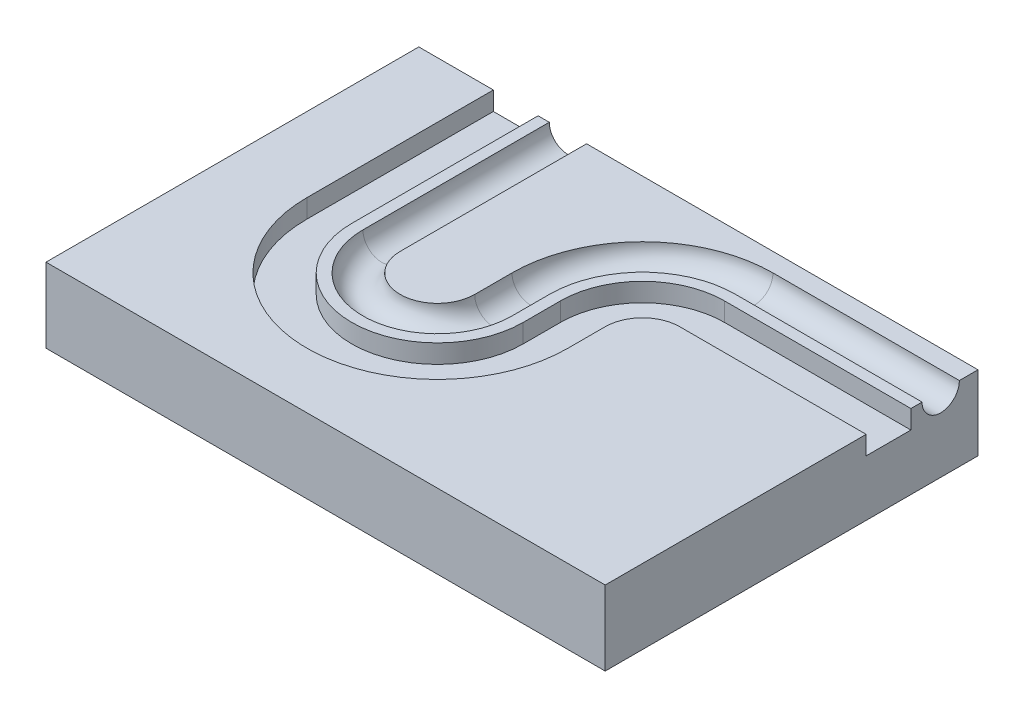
from build123d import *

# Parameters (mm, degrees)
SKETCH1_W      = 150
SKETCH1_H      = 100
EXTRUDE1_DEPTH = 10
SKETCH3_R      = 5
SKETCH3_W      = 12
SKETCH3_H      = 5


with BuildPart() as part:
    # Sketch1 → Extrude1 (new, symmetric)
    with BuildSketch(Plane(origin=(0, 0, 0), x_dir=(1, 0, 0), z_dir=(0, 1, 0))):
        with Locations((75, 50)):
            Rectangle(SKETCH1_W, SKETCH1_H)
    extrude(amount=EXTRUDE1_DEPTH, both=True)

    # Cut-Sweep1: sweep along a path in Sketch2
    with BuildLine(Plane(origin=(0, 10, 0), x_dir=(-1, 0, 0), z_dir=(0, 1, 0))) as cut_sweep1_path:
        Line((-150, -70), (-100, -70))
        ThreePointArc((-100, -70), (-92.928932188, -67.071067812), (-90, -60))
        Line((-90, -60), (-90, -50))
        ThreePointArc((-90, -50), (-55, -15), (-20, -50))
        Line((-20, -50), (-20, -100))
    # Sketch3 → Cut-Sweep1 (sweep, cut)
    with BuildSketch(Plane(origin=(150, 0, 0), x_dir=(0, 0, -1), z_dir=(1, 0, 0))):
        with Locations((90, 10)):
            Circle(SKETCH3_R)
        with Locations((76, 7.5)):
            Rectangle(SKETCH3_W, SKETCH3_H)
    sweep(path=cut_sweep1_path.line, mode=Mode.SUBTRACT)


solid = part.part
